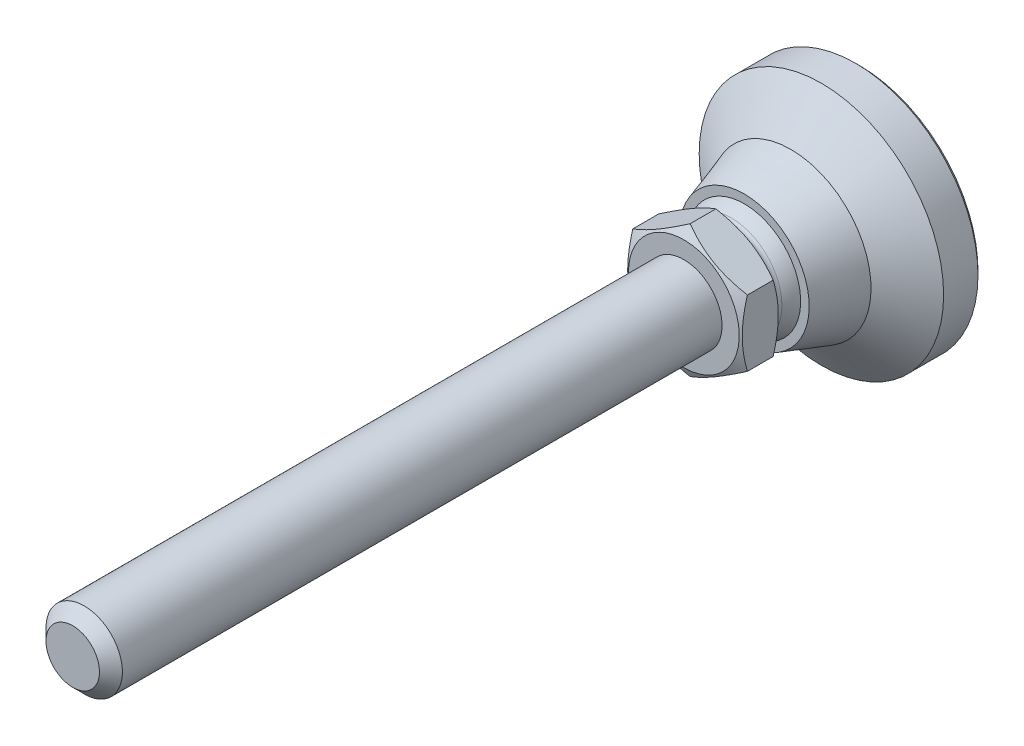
ISO-10303-21;
HEADER;
FILE_DESCRIPTION(('STEP AP214'),'2;1');
FILE_NAME('part.step','',(''),(''),'','','');
FILE_SCHEMA(('AUTOMOTIVE_DESIGN { 1 0 10303 214 1 1 1 1 }'));
ENDSEC;
DATA;
#1=APPLICATION_CONTEXT('core data for automotive mechanical design processes');
#2=APPLICATION_PROTOCOL_DEFINITION('international standard','automotive_design',2000,#1);
#3=PRODUCT_CONTEXT('',#1,'mechanical');
#4=PRODUCT('Part','Part','',(#3));
#5=PRODUCT_RELATED_PRODUCT_CATEGORY('part','',(#4));
#6=PRODUCT_DEFINITION_FORMATION('','',#4);
#7=PRODUCT_DEFINITION_CONTEXT('part definition',#1,'design');
#8=PRODUCT_DEFINITION('design','',#6,#7);
#9=PRODUCT_DEFINITION_SHAPE('','',#8);
#10=(LENGTH_UNIT() NAMED_UNIT(*) SI_UNIT(.MILLI.,.METRE.));
#11=(NAMED_UNIT(*) PLANE_ANGLE_UNIT() SI_UNIT($,.RADIAN.));
#12=(NAMED_UNIT(*) SI_UNIT($,.STERADIAN.) SOLID_ANGLE_UNIT());
#13=UNCERTAINTY_MEASURE_WITH_UNIT(LENGTH_MEASURE(1.E-05),#10,'distance_accuracy_value','');
#14=(GEOMETRIC_REPRESENTATION_CONTEXT(3) GLOBAL_UNCERTAINTY_ASSIGNED_CONTEXT((#13)) GLOBAL_UNIT_ASSIGNED_CONTEXT((#10,
#11,#12)) REPRESENTATION_CONTEXT('',''));
#15=CARTESIAN_POINT('',(0.,0.,0.));
#16=DIRECTION('',(0.,0.,1.));
#17=DIRECTION('',(1.,0.,0.));
#18=AXIS2_PLACEMENT_3D('',#15,#16,#17);
#19=CARTESIAN_POINT('',(-7.3851201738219,0.,15.1));
#20=DIRECTION('',(0.,0.,-1.));
#21=DIRECTION('',(0.,1.,0.));
#22=AXIS2_PLACEMENT_3D('',#19,#20,#21);
#23=PLANE('',#22);
#24=CARTESIAN_POINT('',(0.,0.,15.1));
#25=DIRECTION('',(0.,0.,-1.));
#26=DIRECTION('',(0.,1.,0.));
#27=AXIS2_PLACEMENT_3D('',#24,#25,#26);
#28=CIRCLE('',#27,8.5);
#29=CARTESIAN_POINT('',(0.,8.5,15.1));
#30=VERTEX_POINT('',#29);
#31=EDGE_CURVE('E73',#30,#30,#28,.T.);
#32=ORIENTED_EDGE('',*,*,#31,.F.);
#33=EDGE_LOOP('',(#32));
#34=FACE_BOUND('',#33,.T.);
#35=CARTESIAN_POINT('',(0.,0.,15.1));
#36=DIRECTION('',(0.,0.,-1.));
#37=DIRECTION('',(0.,1.,0.));
#38=AXIS2_PLACEMENT_3D('',#35,#36,#37);
#39=CIRCLE('',#38,7.38512017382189);
#40=CARTESIAN_POINT('',(-7.38512017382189,0.,15.1));
#41=VERTEX_POINT('',#40);
#42=EDGE_CURVE('E85',#41,#41,#39,.T.);
#43=ORIENTED_EDGE('',*,*,#42,.T.);
#44=EDGE_LOOP('',(#43));
#45=FACE_BOUND('',#44,.T.);
#46=ADVANCED_FACE('F14',(#34,#45),#23,.F.);
#47=CARTESIAN_POINT('',(0.,0.,15.1));
#48=DIRECTION('',(0.,0.,-1.));
#49=DIRECTION('',(0.,1.,0.));
#50=AXIS2_PLACEMENT_3D('',#47,#48,#49);
#51=CONICAL_SURFACE('',#50,8.5,0.316824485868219);
#52=CARTESIAN_POINT('',(0.,0.,9.));
#53=DIRECTION('',(0.,0.,-1.));
#54=DIRECTION('',(0.,1.,0.));
#55=AXIS2_PLACEMENT_3D('',#52,#53,#54);
#56=CIRCLE('',#55,10.5);
#57=CARTESIAN_POINT('',(0.,10.5,9.));
#58=VERTEX_POINT('',#57);
#59=EDGE_CURVE('E120',#58,#58,#56,.T.);
#60=ORIENTED_EDGE('',*,*,#59,.F.);
#61=EDGE_LOOP('',(#60));
#62=FACE_BOUND('',#61,.T.);
#63=ORIENTED_EDGE('',*,*,#31,.T.);
#64=EDGE_LOOP('',(#63));
#65=FACE_BOUND('',#64,.T.);
#66=ADVANCED_FACE('F241',(#62,#65),#51,.T.);
#67=CARTESIAN_POINT('',(0.,0.,9.));
#68=DIRECTION('',(0.,0.,-1.));
#69=DIRECTION('',(0.,1.,0.));
#70=AXIS2_PLACEMENT_3D('',#67,#68,#69);
#71=CONICAL_SURFACE('',#70,10.5,0.942000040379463);
#72=CARTESIAN_POINT('',(0.,0.,5.));
#73=DIRECTION('',(0.,0.,-1.));
#74=DIRECTION('',(0.,1.,0.));
#75=AXIS2_PLACEMENT_3D('',#72,#73,#74);
#76=CIRCLE('',#75,16.);
#77=CARTESIAN_POINT('',(0.,16.,5.));
#78=VERTEX_POINT('',#77);
#79=EDGE_CURVE('E117',#78,#78,#76,.T.);
#80=ORIENTED_EDGE('',*,*,#79,.F.);
#81=EDGE_LOOP('',(#80));
#82=FACE_BOUND('',#81,.T.);
#83=ORIENTED_EDGE('',*,*,#59,.T.);
#84=EDGE_LOOP('',(#83));
#85=FACE_BOUND('',#84,.T.);
#86=ADVANCED_FACE('F246',(#82,#85),#71,.T.);
#87=CARTESIAN_POINT('',(0.,0.,0.));
#88=DIRECTION('',(0.,0.,-1.));
#89=DIRECTION('',(0.,1.,0.));
#90=AXIS2_PLACEMENT_3D('',#87,#88,#89);
#91=CYLINDRICAL_SURFACE('',#90,16.);
#92=CARTESIAN_POINT('',(0.,0.,0.5));
#93=DIRECTION('',(0.,0.,-1.));
#94=DIRECTION('',(0.,1.,0.));
#95=AXIS2_PLACEMENT_3D('',#92,#93,#94);
#96=CIRCLE('',#95,16.);
#97=CARTESIAN_POINT('',(0.,16.,0.5));
#98=VERTEX_POINT('',#97);
#99=EDGE_CURVE('E114',#98,#98,#96,.T.);
#100=ORIENTED_EDGE('',*,*,#99,.F.);
#101=EDGE_LOOP('',(#100));
#102=FACE_BOUND('',#101,.T.);
#103=ORIENTED_EDGE('',*,*,#79,.T.);
#104=EDGE_LOOP('',(#103));
#105=FACE_BOUND('',#104,.T.);
#106=ADVANCED_FACE('F254',(#102,#105),#91,.T.);
#107=CARTESIAN_POINT('',(0.,0.,0.5));
#108=DIRECTION('',(0.,0.,1.));
#109=DIRECTION('',(0.,-1.,0.));
#110=AXIS2_PLACEMENT_3D('',#107,#108,#109);
#111=CONICAL_SURFACE('',#110,16.,0.785398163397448);
#112=CARTESIAN_POINT('',(0.,0.,0.));
#113=DIRECTION('',(0.,0.,-1.));
#114=DIRECTION('',(0.,1.,0.));
#115=AXIS2_PLACEMENT_3D('',#112,#113,#114);
#116=CIRCLE('',#115,15.5);
#117=CARTESIAN_POINT('',(0.,15.5,0.));
#118=VERTEX_POINT('',#117);
#119=EDGE_CURVE('E111',#118,#118,#116,.T.);
#120=ORIENTED_EDGE('',*,*,#119,.F.);
#121=EDGE_LOOP('',(#120));
#122=FACE_BOUND('',#121,.T.);
#123=ORIENTED_EDGE('',*,*,#99,.T.);
#124=EDGE_LOOP('',(#123));
#125=FACE_BOUND('',#124,.T.);
#126=ADVANCED_FACE('F258',(#122,#125),#111,.T.);
#127=CARTESIAN_POINT('',(0.,0.,0.));
#128=DIRECTION('',(0.,0.,1.));
#129=DIRECTION('',(0.,-1.,0.));
#130=AXIS2_PLACEMENT_3D('',#127,#128,#129);
#131=PLANE('',#130);
#132=ORIENTED_EDGE('',*,*,#119,.T.);
#133=EDGE_LOOP('',(#132));
#134=FACE_BOUND('',#133,.T.);
#135=ADVANCED_FACE('F262',(#134),#131,.F.);
#136=CARTESIAN_POINT('',(0.,0.,17.2011230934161));
#137=DIRECTION('',(0.,0.,-1.));
#138=DIRECTION('',(0.,1.,0.));
#139=AXIS2_PLACEMENT_3D('',#136,#137,#138);
#140=TOROIDAL_SURFACE('',#139,7.30000021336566,0.799999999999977);
#141=CARTESIAN_POINT('',(0.,0.,18.000000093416));
#142=DIRECTION('',(0.,0.,1.));
#143=DIRECTION('',(1.,0.,0.));
#144=AXIS2_PLACEMENT_3D('',#141,#142,#143);
#145=CIRCLE('',#144,7.25762641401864);
#146=CARTESIAN_POINT('',(7.25762641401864,0.,18.000000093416));
#147=VERTEX_POINT('',#146);
#148=EDGE_CURVE('E291',#147,#147,#145,.F.);
#149=ORIENTED_EDGE('',*,*,#148,.T.);
#150=EDGE_LOOP('',(#149));
#151=FACE_BOUND('',#150,.T.);
#152=CARTESIAN_POINT('',(0.,0.,16.7846437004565));
#153=DIRECTION('',(0.,0.,-1.));
#154=DIRECTION('',(0.,1.,0.));
#155=AXIS2_PLACEMENT_3D('',#152,#153,#154);
#156=CIRCLE('',#155,6.6169592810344);
#157=CARTESIAN_POINT('',(-6.61695928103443,0.,16.7846437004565));
#158=VERTEX_POINT('',#157);
#159=EDGE_CURVE('E88',#158,#158,#156,.T.);
#160=ORIENTED_EDGE('',*,*,#159,.F.);
#161=EDGE_LOOP('',(#160));
#162=FACE_BOUND('',#161,.T.);
#163=ADVANCED_FACE('F266',(#151,#162),#140,.F.);
#164=CARTESIAN_POINT('',(-1.12535508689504E-07,0.,12.7500000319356));
#165=DIRECTION('',(0.,0.,-1.));
#166=DIRECTION('',(-1.,0.,0.));
#167=AXIS2_PLACEMENT_3D('',#164,#165,#166);
#168=SPHERICAL_SURFACE('',#167,7.74999988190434);
#169=CARTESIAN_POINT('',(-7.38512017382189,0.,15.1));
#170=CARTESIAN_POINT('',(-7.37925798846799,0.,15.1184225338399));
#171=CARTESIAN_POINT('',(-7.37332686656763,0.,15.1368231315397));
#172=CARTESIAN_POINT('',(-7.36132708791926,0.,15.1735794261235));
#173=CARTESIAN_POINT('',(-7.35525843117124,0.,15.1919351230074));
#174=CARTESIAN_POINT('',(-7.34298392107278,0.,15.2286005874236));
#175=CARTESIAN_POINT('',(-7.33677806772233,0.,15.246910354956));
#176=CARTESIAN_POINT('',(-7.32422951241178,0.,15.2834829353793));
#177=CARTESIAN_POINT('',(-7.31788681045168,0.,15.3017457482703));
#178=CARTESIAN_POINT('',(-7.30506491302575,0.,15.3382233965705));
#179=CARTESIAN_POINT('',(-7.29858571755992,0.,15.3564382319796));
#180=CARTESIAN_POINT('',(-7.2854911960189,0.,15.3928189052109));
#181=CARTESIAN_POINT('',(-7.27887586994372,0.,15.4109847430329));
#182=CARTESIAN_POINT('',(-7.2655094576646,0.,15.447266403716));
#183=CARTESIAN_POINT('',(-7.25875837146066,0.,15.4653822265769));
#184=CARTESIAN_POINT('',(-7.2451208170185,0.,15.5015628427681));
#185=CARTESIAN_POINT('',(-7.23823434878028,0.,15.5196276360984));
#186=CARTESIAN_POINT('',(-7.22432641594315,0.,15.5557051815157));
#187=CARTESIAN_POINT('',(-7.21730495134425,0.,15.5737179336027));
#188=CARTESIAN_POINT('',(-7.20312741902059,0.,15.6096903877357));
#189=CARTESIAN_POINT('',(-7.19597135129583,0.,15.6276500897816));
#190=CARTESIAN_POINT('',(-7.18152501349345,0.,15.6635154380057));
#191=CARTESIAN_POINT('',(-7.17423474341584,0.,15.6814210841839));
#192=CARTESIAN_POINT('',(-7.15952040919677,0.,15.717177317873));
#193=CARTESIAN_POINT('',(-7.15209634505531,0.,15.7350279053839));
#194=CARTESIAN_POINT('',(-7.13711483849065,0.,15.7706730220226));
#195=CARTESIAN_POINT('',(-7.12955739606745,0.,15.7884675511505));
#196=CARTESIAN_POINT('',(-7.11430955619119,0.,15.8239995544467));
#197=CARTESIAN_POINT('',(-7.10661915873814,0.,15.8417370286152));
#198=CARTESIAN_POINT('',(-7.09110583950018,0.,15.8771539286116));
#199=CARTESIAN_POINT('',(-7.08328291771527,0.,15.8948333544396));
#200=CARTESIAN_POINT('',(-7.06750498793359,0.,15.9301331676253));
#201=CARTESIAN_POINT('',(-7.0595499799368,0.,15.9477535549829));
#202=CARTESIAN_POINT('',(-7.04350832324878,0.,15.9829343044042));
#203=CARTESIAN_POINT('',(-7.03542167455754,0.,16.0004946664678));
#204=CARTESIAN_POINT('',(-7.01911718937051,0.,16.0355543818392));
#205=CARTESIAN_POINT('',(-7.01089935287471,0.,16.0530537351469));
#206=CARTESIAN_POINT('',(-6.99433295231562,0.,16.0879904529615));
#207=CARTESIAN_POINT('',(-6.98598438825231,0.,16.1054278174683));
#208=CARTESIAN_POINT('',(-6.96915700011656,0.,16.1402395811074));
#209=CARTESIAN_POINT('',(-6.96067817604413,0.,16.1576139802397));
#210=CARTESIAN_POINT('',(-6.94359074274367,0.,16.1922988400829));
#211=CARTESIAN_POINT('',(-6.93498213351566,0.,16.2096093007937));
#212=CARTESIAN_POINT('',(-6.91763561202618,0.,16.2441653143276));
#213=CARTESIAN_POINT('',(-6.90889769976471,0.,16.2614108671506));
#214=CARTESIAN_POINT('',(-6.89129306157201,0.,16.2958360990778));
#215=CARTESIAN_POINT('',(-6.88242633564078,0.,16.313015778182));
#216=CARTESIAN_POINT('',(-6.86456456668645,0.,16.3473083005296));
#217=CARTESIAN_POINT('',(-6.85556952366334,0.,16.364421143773));
#218=CARTESIAN_POINT('',(-6.83745162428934,0.,16.3985790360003));
#219=CARTESIAN_POINT('',(-6.82832876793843,0.,16.4156240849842));
#220=CARTESIAN_POINT('',(-6.80995575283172,0.,16.4496454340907));
#221=CARTESIAN_POINT('',(-6.80070559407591,0.,16.4666217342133));
#222=CARTESIAN_POINT('',(-6.78207849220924,0.,16.5005046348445));
#223=CARTESIAN_POINT('',(-6.77270154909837,0.,16.517411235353));
#224=CARTESIAN_POINT('',(-6.75382140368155,0.,16.5511537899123));
#225=CARTESIAN_POINT('',(-6.7443182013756,0.,16.5679897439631));
#226=CARTESIAN_POINT('',(-6.72518606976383,0.,16.6015900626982));
#227=CARTESIAN_POINT('',(-6.71555714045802,0.,16.6183544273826));
#228=CARTESIAN_POINT('',(-6.69617409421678,0.,16.6518106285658));
#229=CARTESIAN_POINT('',(-6.68641997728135,0.,16.6685024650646));
#230=CARTESIAN_POINT('',(-6.66678710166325,0.,16.7018126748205));
#231=CARTESIAN_POINT('',(-6.65690834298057,0.,16.7184310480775));
#232=CARTESIAN_POINT('',(-6.63702673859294,0.,16.7515934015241));
#233=CARTESIAN_POINT('',(-6.627023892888,0.,16.7681373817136));
#234=CARTESIAN_POINT('',(-6.61695928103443,0.,16.7846437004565));
#235=B_SPLINE_CURVE_WITH_KNOTS('',3,(#169,#170,#171,#172,#173,#174,#175,#176,#177,#178,#179,
#180,#181,#182,#183,#184,#185,#186,#187,#188,#189,#190,#191,#192,#193,#194,#195,#196,#197,#198,
#199,#200,#201,#202,#203,#204,#205,#206,#207,#208,#209,#210,#211,#212,#213,#214,#215,#216,#217,
#218,#219,#220,#221,#222,#223,#224,#225,#226,#227,#228,#229,#230,#231,#232,#233,#234),
.UNSPECIFIED.,.F.,.F.,(4,2,2,2,2,2,2,2,2,2,2,2,2,2,2,2,2,2,2,2,2,2,2,2,2,2,2,2,2,2,2,2,4),(0.,
0.0579980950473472,0.115996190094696,0.173994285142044,0.231992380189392,0.28999047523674,
0.347988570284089,0.405986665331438,0.463984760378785,0.521982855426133,0.579980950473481,
0.637979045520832,0.695977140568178,0.753975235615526,0.811973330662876,0.869971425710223,
0.927969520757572,0.98596761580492,1.04396571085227,1.10196380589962,1.15996190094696,
1.21795999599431,1.27595809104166,1.33395618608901,1.39195428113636,1.44995237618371,
1.50795047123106,1.5659485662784,1.62394666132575,1.6819447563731,1.73994285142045,
1.79794094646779,1.85593904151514),.UNSPECIFIED.);
#236=EDGE_CURVE('BSEAM272',#41,#158,#235,.T.);
#237=ORIENTED_EDGE('',*,*,#42,.F.);
#238=ORIENTED_EDGE('',*,*,#159,.T.);
#239=ORIENTED_EDGE('',*,*,#236,.T.);
#240=ORIENTED_EDGE('',*,*,#236,.F.);
#241=EDGE_LOOP('',(#237,#239,#238,#240));
#242=FACE_BOUND('',#241,.T.);
#243=ADVANCED_FACE('F272',(#242),#168,.T.);
#244=CARTESIAN_POINT('',(0.,7.25,18.000000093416));
#245=DIRECTION('',(0.,0.,-1.));
#246=DIRECTION('',(-1.,0.,0.));
#247=AXIS2_PLACEMENT_3D('',#244,#245,#246);
#248=PLANE('',#247);
#249=CARTESIAN_POINT('',(0.,0.,18.000000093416));
#250=DIRECTION('',(0.,0.,-1.));
#251=DIRECTION('',(-1.,0.,0.));
#252=AXIS2_PLACEMENT_3D('',#249,#250,#251);
#253=CIRCLE('',#252,7.25);
#254=CARTESIAN_POINT('',(-7.25,0.,18.000000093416));
#255=VERTEX_POINT('',#254);
#256=EDGE_CURVE('E79',#255,#255,#253,.T.);
#257=ORIENTED_EDGE('',*,*,#256,.T.);
#258=EDGE_LOOP('',(#257));
#259=FACE_BOUND('',#258,.T.);
#260=ORIENTED_EDGE('',*,*,#148,.F.);
#261=EDGE_LOOP('',(#260));
#262=FACE_BOUND('',#261,.T.);
#263=ADVANCED_FACE('F139',(#259,#262),#248,.F.);
#264=CARTESIAN_POINT('',(0.,0.,19.9415360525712));
#265=DIRECTION('',(0.,0.,1.));
#266=DIRECTION('',(1.,0.,0.));
#267=AXIS2_PLACEMENT_3D('',#264,#265,#266);
#268=CONICAL_SURFACE('',#267,10.6128389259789,1.0471975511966);
#269=CARTESIAN_POINT('',(-7.5002,4.33001154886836,18.8142773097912));
#270=CARTESIAN_POINT('',(-7.3353416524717,4.42519256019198,18.7593329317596));
#271=CARTESIAN_POINT('',(-7.16986863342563,4.52072845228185,18.7068821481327));
#272=CARTESIAN_POINT('',(-6.83757877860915,4.71257608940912,18.6076545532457));
#273=CARTESIAN_POINT('',(-6.67076139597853,4.80888815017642,18.5608801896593));
#274=CARTESIAN_POINT('',(-6.16763831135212,5.09936639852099,18.4299898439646));
#275=CARTESIAN_POINT('',(-5.82934661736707,5.29467919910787,18.35554096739));
#276=CARTESIAN_POINT('',(-5.32309925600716,5.58696124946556,18.2682409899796));
#277=CARTESIAN_POINT('',(-5.15665618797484,5.68305719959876,18.2433717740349));
#278=CARTESIAN_POINT('',(-4.82301799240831,5.87568330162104,18.2016697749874));
#279=CARTESIAN_POINT('',(-4.65582293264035,5.97221341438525,18.1848362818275));
#280=CARTESIAN_POINT('',(-4.32114243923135,6.16544128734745,18.1596347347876));
#281=CARTESIAN_POINT('',(-4.15365755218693,6.26213873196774,18.1512570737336));
#282=CARTESIAN_POINT('',(-3.81854232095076,6.45561760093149,18.1431378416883));
#283=CARTESIAN_POINT('',(-3.65091198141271,6.55239902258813,18.1433960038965));
#284=CARTESIAN_POINT('',(-3.19166219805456,6.81754700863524,18.15597366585));
#285=CARTESIAN_POINT('',(-2.90019309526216,6.98582677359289,18.1770873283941));
#286=CARTESIAN_POINT('',(-2.31919079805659,7.32126860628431,18.2440382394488));
#287=CARTESIAN_POINT('',(-2.02965964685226,7.48842949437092,18.2898983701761));
#288=CARTESIAN_POINT('',(-1.44748813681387,7.82454637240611,18.4045351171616));
#289=CARTESIAN_POINT('',(-1.15492123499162,7.99345995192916,18.4737974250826));
#290=CARTESIAN_POINT('',(-0.574150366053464,8.3287681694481,18.6309948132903));
#291=CARTESIAN_POINT('',(-0.285938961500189,8.49516710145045,18.7188929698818));
#292=CARTESIAN_POINT('',(0.000200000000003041,8.66036950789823,18.8142773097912));
#293=B_SPLINE_CURVE_WITH_KNOTS('',3,(#269,#270,#271,#272,#273,#274,#275,#276,#277,#278,#279,
#280,#281,#282,#283,#284,#285,#286,#287,#288,#289,#290,#291,#292),.UNSPECIFIED.,.F.,.F.,(4,2,2,
2,2,2,2,2,2,2,2,4),(0.,0.594350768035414,1.1889569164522,2.38063993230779,2.96188692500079,
3.54308254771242,4.12361709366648,4.70413370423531,5.71473675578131,6.72627588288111,
7.76024925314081,8.79219281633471),.UNSPECIFIED.);
#294=CARTESIAN_POINT('',(-7.5,4.3301270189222,18.8142106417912));
#295=VERTEX_POINT('',#294);
#296=CARTESIAN_POINT('',(0.,8.66025403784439,18.8142106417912));
#297=VERTEX_POINT('',#296);
#298=EDGE_CURVE('E29',#295,#297,#293,.T.);
#299=ORIENTED_EDGE('',*,*,#298,.T.);
#300=CARTESIAN_POINT('',(-0.000199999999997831,8.66036950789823,18.8142773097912));
#301=CARTESIAN_POINT('',(0.164658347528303,8.56518849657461,18.7593329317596));
#302=CARTESIAN_POINT('',(0.330131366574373,8.46965260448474,18.7068821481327));
#303=CARTESIAN_POINT('',(0.662421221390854,8.27780496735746,18.6076545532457));
#304=CARTESIAN_POINT('',(0.829238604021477,8.18149290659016,18.5608801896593));
#305=CARTESIAN_POINT('',(1.33236168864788,7.8910146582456,18.4299898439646));
#306=CARTESIAN_POINT('',(1.67065338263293,7.69570185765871,18.35554096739));
#307=CARTESIAN_POINT('',(2.17690074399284,7.40341980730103,18.2682409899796));
#308=CARTESIAN_POINT('',(2.34334381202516,7.30732385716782,18.2433717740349));
#309=CARTESIAN_POINT('',(2.67698200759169,7.11469775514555,18.2016697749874));
#310=CARTESIAN_POINT('',(2.84417706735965,7.01816764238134,18.1848362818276));
#311=CARTESIAN_POINT('',(3.17885756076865,6.82493976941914,18.1596347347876));
#312=CARTESIAN_POINT('',(3.34634244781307,6.72824232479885,18.1512570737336));
#313=CARTESIAN_POINT('',(3.68145767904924,6.5347634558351,18.1431378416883));
#314=CARTESIAN_POINT('',(3.84908801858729,6.43798203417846,18.1433960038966));
#315=CARTESIAN_POINT('',(4.30833780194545,6.17283404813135,18.1559736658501));
#316=CARTESIAN_POINT('',(4.59980690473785,6.0045542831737,18.1770873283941));
#317=CARTESIAN_POINT('',(5.18080920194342,5.66911245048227,18.2440382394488));
#318=CARTESIAN_POINT('',(5.47034035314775,5.50195156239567,18.2898983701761));
#319=CARTESIAN_POINT('',(6.05251186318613,5.16583468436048,18.4045351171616));
#320=CARTESIAN_POINT('',(6.34507876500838,4.99692110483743,18.4737974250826));
#321=CARTESIAN_POINT('',(6.92584963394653,4.66161288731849,18.6309948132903));
#322=CARTESIAN_POINT('',(7.21406103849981,4.49521395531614,18.7188929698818));
#323=CARTESIAN_POINT('',(7.5002,4.33001154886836,18.8142773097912));
#324=B_SPLINE_CURVE_WITH_KNOTS('',3,(#300,#301,#302,#303,#304,#305,#306,#307,#308,#309,#310,
#311,#312,#313,#314,#315,#316,#317,#318,#319,#320,#321,#322,#323),.UNSPECIFIED.,.F.,.F.,(4,2,2,
2,2,2,2,2,2,2,2,4),(0.,0.594350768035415,1.1889569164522,2.38063993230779,2.96188692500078,
3.54308254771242,4.12361709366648,4.70413370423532,5.71473675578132,6.72627588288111,
7.7602492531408,8.7921928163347),.UNSPECIFIED.);
#325=CARTESIAN_POINT('',(7.5,4.3301270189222,18.8142106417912));
#326=VERTEX_POINT('',#325);
#327=EDGE_CURVE('E66',#297,#326,#324,.T.);
#328=ORIENTED_EDGE('',*,*,#327,.T.);
#329=CARTESIAN_POINT('',(7.5,-11.6210388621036,21.7995836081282));
#330=CARTESIAN_POINT('',(7.5,-11.2935497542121,21.6407631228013));
#331=CARTESIAN_POINT('',(7.5,-10.9653077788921,21.4834684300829));
#332=CARTESIAN_POINT('',(7.5,-10.3069176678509,21.1727889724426));
#333=CARTESIAN_POINT('',(7.5,-9.97676924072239,21.0194048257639));
#334=CARTESIAN_POINT('',(7.5,-9.31245989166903,20.7166309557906));
#335=CARTESIAN_POINT('',(7.5,-8.9782869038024,20.5672676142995));
#336=CARTESIAN_POINT('',(7.5,-8.30727950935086,20.27466703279));
#337=CARTESIAN_POINT('',(7.5,-7.97044522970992,20.1314295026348));
#338=CARTESIAN_POINT('',(7.5,-7.28274678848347,19.8482374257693));
#339=CARTESIAN_POINT('',(7.5,-6.93177846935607,19.7085344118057));
#340=CARTESIAN_POINT('',(7.5,-6.22573282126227,19.4397263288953));
#341=CARTESIAN_POINT('',(7.5,-5.87065503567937,19.3106224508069));
#342=CARTESIAN_POINT('',(7.5,-5.15648914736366,19.0664097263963));
#343=CARTESIAN_POINT('',(7.5,-4.79741086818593,18.951272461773));
#344=CARTESIAN_POINT('',(7.5,-4.0741164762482,18.7386927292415));
#345=CARTESIAN_POINT('',(7.5,-3.70990202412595,18.641244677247));
#346=CARTESIAN_POINT('',(7.5,-2.97808734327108,18.4692508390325));
#347=CARTESIAN_POINT('',(7.5,-2.61051701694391,18.3945812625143));
#348=CARTESIAN_POINT('',(7.5,-2.05582247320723,18.3028985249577));
#349=CARTESIAN_POINT('',(7.5,-1.87035408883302,18.275723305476));
#350=CARTESIAN_POINT('',(7.5,-1.49849891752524,18.2286800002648));
#351=CARTESIAN_POINT('',(7.5,-1.3121122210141,18.2088112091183));
#352=CARTESIAN_POINT('',(7.5,-0.941100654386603,18.1770252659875));
#353=CARTESIAN_POINT('',(7.5,-0.756484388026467,18.1650080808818));
#354=CARTESIAN_POINT('',(7.5,-0.386909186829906,18.148790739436));
#355=CARTESIAN_POINT('',(7.5,-0.201950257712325,18.144590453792));
#356=CARTESIAN_POINT('',(7.5,0.16797978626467,18.1441070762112));
#357=CARTESIAN_POINT('',(7.5,0.352950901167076,18.1478240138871));
#358=CARTESIAN_POINT('',(7.5,0.722572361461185,18.1630844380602));
#359=CARTESIAN_POINT('',(7.5,0.907222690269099,18.1746283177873));
#360=CARTESIAN_POINT('',(7.5,1.35130171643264,18.2115591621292));
#361=CARTESIAN_POINT('',(7.5,1.61042666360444,18.2406768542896));
#362=CARTESIAN_POINT('',(7.5,2.1267344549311,18.3127350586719));
#363=CARTESIAN_POINT('',(7.5,2.38391702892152,18.3556774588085));
#364=CARTESIAN_POINT('',(7.5,3.15226770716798,18.5029630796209));
#365=CARTESIAN_POINT('',(7.5,3.6599484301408,18.6257373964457));
#366=CARTESIAN_POINT('',(7.5,4.4190540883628,18.8384053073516));
#367=CARTESIAN_POINT('',(7.5,4.67442232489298,18.9150310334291));
#368=CARTESIAN_POINT('',(7.5,5.18267806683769,19.076183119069));
#369=CARTESIAN_POINT('',(7.5,5.43556555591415,19.1607095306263));
#370=CARTESIAN_POINT('',(7.5,5.93894047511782,19.336311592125));
#371=CARTESIAN_POINT('',(7.5,6.18942867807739,19.4273850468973));
#372=CARTESIAN_POINT('',(7.5,6.68833359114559,19.6150154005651));
#373=CARTESIAN_POINT('',(7.5,6.93675032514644,19.7115722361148));
#374=CARTESIAN_POINT('',(7.5,7.5215160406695,19.9451104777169));
#375=CARTESIAN_POINT('',(7.5,7.85708059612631,20.084052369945));
#376=CARTESIAN_POINT('',(7.5,8.52536966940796,20.3686255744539));
#377=CARTESIAN_POINT('',(7.5,8.85809401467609,20.5142572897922));
#378=CARTESIAN_POINT('',(7.5,9.521223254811,20.8108704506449));
#379=CARTESIAN_POINT('',(7.5,9.85162767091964,20.9618529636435));
#380=CARTESIAN_POINT('',(7.5,10.5104495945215,21.2681000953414));
#381=CARTESIAN_POINT('',(7.5,10.8388670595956,21.4233648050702));
#382=CARTESIAN_POINT('',(7.5,11.4943809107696,21.737538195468));
#383=CARTESIAN_POINT('',(7.5,11.821475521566,21.8964505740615));
#384=CARTESIAN_POINT('',(7.5,12.4742575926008,22.2171423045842));
#385=CARTESIAN_POINT('',(7.5,12.7999450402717,22.3789216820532));
#386=CARTESIAN_POINT('',(7.5,13.7751460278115,22.8677567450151));
#387=CARTESIAN_POINT('',(7.5,14.4228853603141,23.1983514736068));
#388=CARTESIAN_POINT('',(7.5,15.6609333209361,23.8382767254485));
#389=CARTESIAN_POINT('',(7.5,16.2515179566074,24.1470756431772));
#390=CARTESIAN_POINT('',(7.5,17.4304917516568,24.7688832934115));
#391=CARTESIAN_POINT('',(7.5,18.0188808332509,25.0818921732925));
#392=CARTESIAN_POINT('',(7.5,19.1924888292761,25.7103373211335));
#393=CARTESIAN_POINT('',(7.5,19.777711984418,26.0257656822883));
#394=CARTESIAN_POINT('',(7.5,20.9467538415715,26.6591392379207));
#395=CARTESIAN_POINT('',(7.5,21.530572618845,26.9770842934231));
#396=CARTESIAN_POINT('',(7.5,22.1138741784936,27.2959690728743));
#397=B_SPLINE_CURVE_WITH_KNOTS('',3,(#329,#330,#331,#332,#333,#334,#335,#336,#337,#338,#339,
#340,#341,#342,#343,#344,#345,#346,#347,#348,#349,#350,#351,#352,#353,#354,#355,#356,#357,#358,
#359,#360,#361,#362,#363,#364,#365,#366,#367,#368,#369,#370,#371,#372,#373,#374,#375,#376,#377,
#378,#379,#380,#381,#382,#383,#384,#385,#386,#387,#388,#389,#390,#391,#392,#393,#394,#395,#396),
.UNSPECIFIED.,.F.,.F.,(4,2,2,2,2,2,2,2,2,2,2,2,2,2,2,2,2,2,2,2,2,2,2,2,2,2,2,2,2,2,2,2,2,4),(0.,
1.09191885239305,2.18400927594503,3.28206244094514,4.38006354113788,5.5131832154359,
6.64643002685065,7.77733086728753,8.90787408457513,10.0321591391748,10.5943839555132,
11.1565544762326,11.7114152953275,12.2662669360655,12.8211206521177,13.3760022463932,
14.157827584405,14.9397597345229,16.504494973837,17.3042788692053,18.1040680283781,
18.9035902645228,19.7031032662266,20.7925815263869,21.8821255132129,22.971888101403,
24.0616738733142,25.1526180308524,26.2435719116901,28.4251893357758,30.4245018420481,
32.4238845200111,34.4183279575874,36.4126620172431),.UNSPECIFIED.);
#398=CARTESIAN_POINT('',(7.5,-4.3301270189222,18.8142106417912));
#399=VERTEX_POINT('',#398);
#400=EDGE_CURVE('E69',#326,#399,#397,.F.);
#401=ORIENTED_EDGE('',*,*,#400,.T.);
#402=CARTESIAN_POINT('',(7.5002,-4.33001154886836,18.8142773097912));
#403=CARTESIAN_POINT('',(7.3353416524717,-4.42519256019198,18.7593329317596));
#404=CARTESIAN_POINT('',(7.16986863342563,-4.52072845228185,18.7068821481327));
#405=CARTESIAN_POINT('',(6.83757877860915,-4.71257608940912,18.6076545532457));
#406=CARTESIAN_POINT('',(6.67076139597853,-4.80888815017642,18.5608801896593));
#407=CARTESIAN_POINT('',(6.16763831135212,-5.09936639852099,18.4299898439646));
#408=CARTESIAN_POINT('',(5.82934661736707,-5.29467919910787,18.35554096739));
#409=CARTESIAN_POINT('',(5.32309925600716,-5.58696124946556,18.2682409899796));
#410=CARTESIAN_POINT('',(5.15665618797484,-5.68305719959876,18.2433717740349));
#411=CARTESIAN_POINT('',(4.82301799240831,-5.87568330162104,18.2016697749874));
#412=CARTESIAN_POINT('',(4.65582293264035,-5.97221341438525,18.1848362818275));
#413=CARTESIAN_POINT('',(4.32114243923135,-6.16544128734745,18.1596347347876));
#414=CARTESIAN_POINT('',(4.15365755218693,-6.26213873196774,18.1512570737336));
#415=CARTESIAN_POINT('',(3.81854232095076,-6.45561760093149,18.1431378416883));
#416=CARTESIAN_POINT('',(3.65091198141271,-6.55239902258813,18.1433960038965));
#417=CARTESIAN_POINT('',(3.19166219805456,-6.81754700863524,18.15597366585));
#418=CARTESIAN_POINT('',(2.90019309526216,-6.98582677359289,18.1770873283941));
#419=CARTESIAN_POINT('',(2.31919079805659,-7.32126860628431,18.2440382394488));
#420=CARTESIAN_POINT('',(2.02965964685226,-7.48842949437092,18.2898983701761));
#421=CARTESIAN_POINT('',(1.44748813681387,-7.82454637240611,18.4045351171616));
#422=CARTESIAN_POINT('',(1.15492123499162,-7.99345995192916,18.4737974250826));
#423=CARTESIAN_POINT('',(0.574150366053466,-8.3287681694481,18.6309948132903));
#424=CARTESIAN_POINT('',(0.28593896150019,-8.49516710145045,18.7188929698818));
#425=CARTESIAN_POINT('',(-0.000200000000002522,-8.66036950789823,18.8142773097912));
#426=B_SPLINE_CURVE_WITH_KNOTS('',3,(#402,#403,#404,#405,#406,#407,#408,#409,#410,#411,#412,
#413,#414,#415,#416,#417,#418,#419,#420,#421,#422,#423,#424,#425),.UNSPECIFIED.,.F.,.F.,(4,2,2,
2,2,2,2,2,2,2,2,4),(0.,0.594350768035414,1.1889569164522,2.38063993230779,2.96188692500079,
3.54308254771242,4.12361709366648,4.70413370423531,5.71473675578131,6.72627588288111,
7.76024925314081,8.7921928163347),.UNSPECIFIED.);
#427=CARTESIAN_POINT('',(0.,-8.66025403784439,18.8142106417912));
#428=VERTEX_POINT('',#427);
#429=EDGE_CURVE('E78',#399,#428,#426,.T.);
#430=ORIENTED_EDGE('',*,*,#429,.T.);
#431=CARTESIAN_POINT('',(0.000199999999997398,-8.66036950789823,18.8142773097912));
#432=CARTESIAN_POINT('',(-0.164658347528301,-8.56518849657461,18.7593329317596));
#433=CARTESIAN_POINT('',(-0.33013136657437,-8.46965260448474,18.7068821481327));
#434=CARTESIAN_POINT('',(-0.66242122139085,-8.27780496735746,18.6076545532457));
#435=CARTESIAN_POINT('',(-0.829238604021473,-8.18149290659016,18.5608801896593));
#436=CARTESIAN_POINT('',(-1.33236168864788,-7.89101465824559,18.4299898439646));
#437=CARTESIAN_POINT('',(-1.67065338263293,-7.69570185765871,18.35554096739));
#438=CARTESIAN_POINT('',(-2.17690074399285,-7.40341980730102,18.2682409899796));
#439=CARTESIAN_POINT('',(-2.34334381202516,-7.30732385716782,18.2433717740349));
#440=CARTESIAN_POINT('',(-2.67698200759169,-7.11469775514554,18.2016697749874));
#441=CARTESIAN_POINT('',(-2.84417706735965,-7.01816764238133,18.1848362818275));
#442=CARTESIAN_POINT('',(-3.17885756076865,-6.82493976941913,18.1596347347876));
#443=CARTESIAN_POINT('',(-3.34634244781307,-6.72824232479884,18.1512570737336));
#444=CARTESIAN_POINT('',(-3.68145767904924,-6.53476345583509,18.1431378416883));
#445=CARTESIAN_POINT('',(-3.84908801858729,-6.43798203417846,18.1433960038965));
#446=CARTESIAN_POINT('',(-4.30833780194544,-6.17283404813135,18.15597366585));
#447=CARTESIAN_POINT('',(-4.59980690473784,-6.0045542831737,18.1770873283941));
#448=CARTESIAN_POINT('',(-5.18080920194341,-5.66911245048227,18.2440382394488));
#449=CARTESIAN_POINT('',(-5.47034035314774,-5.50195156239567,18.2898983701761));
#450=CARTESIAN_POINT('',(-6.05251186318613,-5.16583468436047,18.4045351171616));
#451=CARTESIAN_POINT('',(-6.34507876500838,-4.99692110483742,18.4737974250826));
#452=CARTESIAN_POINT('',(-6.92584963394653,-4.66161288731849,18.6309948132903));
#453=CARTESIAN_POINT('',(-7.21406103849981,-4.49521395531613,18.7188929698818));
#454=CARTESIAN_POINT('',(-7.5002,-4.33001154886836,18.8142773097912));
#455=B_SPLINE_CURVE_WITH_KNOTS('',3,(#431,#432,#433,#434,#435,#436,#437,#438,#439,#440,#441,
#442,#443,#444,#445,#446,#447,#448,#449,#450,#451,#452,#453,#454),.UNSPECIFIED.,.F.,.F.,(4,2,2,
2,2,2,2,2,2,2,2,4),(0.,0.594350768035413,1.1889569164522,2.38063993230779,2.96188692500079,
3.54308254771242,4.12361709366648,4.70413370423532,5.71473675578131,6.72627588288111,
7.76024925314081,8.7921928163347),.UNSPECIFIED.);
#456=CARTESIAN_POINT('',(-7.5,-4.3301270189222,18.8142106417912));
#457=VERTEX_POINT('',#456);
#458=EDGE_CURVE('E161',#428,#457,#455,.T.);
#459=ORIENTED_EDGE('',*,*,#458,.T.);
#460=CARTESIAN_POINT('',(-7.5,-11.6210388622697,21.7995836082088));
#461=CARTESIAN_POINT('',(-7.5,-11.2935497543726,21.6407631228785));
#462=CARTESIAN_POINT('',(-7.5,-10.965307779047,21.4834684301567));
#463=CARTESIAN_POINT('',(-7.5,-10.3069176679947,21.1727889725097));
#464=CARTESIAN_POINT('',(-7.5,-9.97676924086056,21.0194048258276));
#465=CARTESIAN_POINT('',(-7.5,-9.31245989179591,20.7166309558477));
#466=CARTESIAN_POINT('',(-7.5,-8.97828690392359,20.5672676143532));
#467=CARTESIAN_POINT('',(-7.5,-8.30727950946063,20.274667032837));
#468=CARTESIAN_POINT('',(-7.5,-7.97044522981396,20.1314295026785));
#469=CARTESIAN_POINT('',(-7.5,-7.28274678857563,19.8482374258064));
#470=CARTESIAN_POINT('',(-7.5,-6.93177846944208,19.7085344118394));
#471=CARTESIAN_POINT('',(-7.5,-6.22573282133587,19.4397263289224));
#472=CARTESIAN_POINT('',(-7.5,-5.87065503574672,19.3106224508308));
#473=CARTESIAN_POINT('',(-7.5,-5.15648914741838,19.0664097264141));
#474=CARTESIAN_POINT('',(-7.5,-4.79741086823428,18.9512724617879));
#475=CARTESIAN_POINT('',(-7.5,-4.07411647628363,18.7386927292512));
#476=CARTESIAN_POINT('',(-7.5,-3.70990202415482,18.6412446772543));
#477=CARTESIAN_POINT('',(-7.5,-2.97808734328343,18.4692508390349));
#478=CARTESIAN_POINT('',(-7.5,-2.61051701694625,18.3945812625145));
#479=CARTESIAN_POINT('',(-7.5,-2.05582247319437,18.3028985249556));
#480=CARTESIAN_POINT('',(-7.5,-1.87035408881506,18.2757233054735));
#481=CARTESIAN_POINT('',(-7.5,-1.49849891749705,18.2286800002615));
#482=CARTESIAN_POINT('',(-7.5,-1.31211222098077,18.2088112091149));
#483=CARTESIAN_POINT('',(-7.5,-0.941100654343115,18.1770252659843));
#484=CARTESIAN_POINT('',(-7.5,-0.756484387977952,18.1650080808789));
#485=CARTESIAN_POINT('',(-7.5,-0.386909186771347,18.1487907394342));
#486=CARTESIAN_POINT('',(-7.5,-0.201950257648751,18.144590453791));
#487=CARTESIAN_POINT('',(-7.5,0.167979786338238,18.1441070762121));
#488=CARTESIAN_POINT('',(-7.5,0.352950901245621,18.1478240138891));
#489=CARTESIAN_POINT('',(-7.5,0.722572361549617,18.163084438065));
#490=CARTESIAN_POINT('',(-7.5,0.90722269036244,18.1746283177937));
#491=CARTESIAN_POINT('',(-7.5,1.35130171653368,18.2115591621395));
#492=CARTESIAN_POINT('',(-7.5,1.61042666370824,18.2406768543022));
#493=CARTESIAN_POINT('',(-7.5,2.1267344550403,18.312735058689));
#494=CARTESIAN_POINT('',(-7.5,2.38391702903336,18.355677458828));
#495=CARTESIAN_POINT('',(-7.5,3.1522677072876,18.5029630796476));
#496=CARTESIAN_POINT('',(-7.5,3.6599484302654,18.6257373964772));
#497=CARTESIAN_POINT('',(-7.5,4.41905408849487,18.8384053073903));
#498=CARTESIAN_POINT('',(-7.5,4.67442232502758,18.9150310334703));
#499=CARTESIAN_POINT('',(-7.5,5.18267806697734,19.0761831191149));
#500=CARTESIAN_POINT('',(-7.5,5.43556555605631,19.1607095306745));
#501=CARTESIAN_POINT('',(-7.5,5.93894047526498,19.3363115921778));
#502=CARTESIAN_POINT('',(-7.5,6.18942867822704,19.4273850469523));
#503=CARTESIAN_POINT('',(-7.5,6.68833359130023,19.6150154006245));
#504=CARTESIAN_POINT('',(-7.5,6.93675032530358,19.7115722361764));
#505=CARTESIAN_POINT('',(-7.5,7.52151604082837,19.9451104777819));
#506=CARTESIAN_POINT('',(-7.5,7.85708059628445,20.084052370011));
#507=CARTESIAN_POINT('',(-7.5,8.52536966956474,20.3686255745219));
#508=CARTESIAN_POINT('',(-7.5,8.85809401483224,20.514257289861));
#509=CARTESIAN_POINT('',(-7.5,9.52122325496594,20.8108704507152));
#510=CARTESIAN_POINT('',(-7.5,9.85162767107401,20.9618529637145));
#511=CARTESIAN_POINT('',(-7.5,10.5104495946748,21.2681000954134));
#512=CARTESIAN_POINT('',(-7.5,10.8388670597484,21.4233648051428));
#513=CARTESIAN_POINT('',(-7.5,11.4943809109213,21.7375381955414));
#514=CARTESIAN_POINT('',(-7.5,11.8214755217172,21.8964505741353));
#515=CARTESIAN_POINT('',(-7.5,12.4742575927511,22.2171423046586));
#516=CARTESIAN_POINT('',(-7.5,12.7999450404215,22.3789216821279));
#517=CARTESIAN_POINT('',(-7.5,13.7751460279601,22.8677567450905));
#518=CARTESIAN_POINT('',(-7.5,14.4228853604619,23.1983514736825));
#519=CARTESIAN_POINT('',(-7.5,15.660933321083,23.838276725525));
#520=CARTESIAN_POINT('',(-7.5,16.2515179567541,24.1470756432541));
#521=CARTESIAN_POINT('',(-7.5,17.4304917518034,24.7688832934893));
#522=CARTESIAN_POINT('',(-7.5,18.0188808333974,25.0818921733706));
#523=CARTESIAN_POINT('',(-7.5,19.1924888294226,25.7103373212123));
#524=CARTESIAN_POINT('',(-7.5,19.7777119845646,26.0257656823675));
#525=CARTESIAN_POINT('',(-7.5,20.9467538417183,26.6591392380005));
#526=CARTESIAN_POINT('',(-7.5,21.5305726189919,26.9770842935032));
#527=CARTESIAN_POINT('',(-7.5,22.1138741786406,27.2959690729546));
#528=B_SPLINE_CURVE_WITH_KNOTS('',3,(#460,#461,#462,#463,#464,#465,#466,#467,#468,#469,#470,
#471,#472,#473,#474,#475,#476,#477,#478,#479,#480,#481,#482,#483,#484,#485,#486,#487,#488,#489,
#490,#491,#492,#493,#494,#495,#496,#497,#498,#499,#500,#501,#502,#503,#504,#505,#506,#507,#508,
#509,#510,#511,#512,#513,#514,#515,#516,#517,#518,#519,#520,#521,#522,#523,#524,#525,#526,#527),
.UNSPECIFIED.,.F.,.F.,(4,2,2,2,2,2,2,2,2,2,2,2,2,2,2,2,2,2,2,2,2,2,2,2,2,2,2,2,2,2,2,2,2,4),(0.,
1.09191885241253,2.18400927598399,3.2820624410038,4.38006354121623,5.51318321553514,
6.6464300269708,7.77733086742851,8.90787408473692,10.0321591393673,10.5943839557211,
11.1565544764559,11.7114152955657,12.2662669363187,12.8211206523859,13.3760022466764,
14.1578275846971,14.939759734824,16.5044949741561,17.3042788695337,18.1040680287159,
18.9035902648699,19.7031032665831,20.7925815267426,21.8821255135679,22.9718881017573,
24.0616738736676,25.1526180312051,26.2435719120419,28.4251893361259,30.4245018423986,
32.4238845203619,34.4183279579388,36.4126620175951),.UNSPECIFIED.);
#529=EDGE_CURVE('E168',#457,#295,#528,.T.);
#530=ORIENTED_EDGE('',*,*,#529,.T.);
#531=EDGE_LOOP('',(#299,#328,#401,#430,#459,#530));
#532=FACE_BOUND('',#531,.T.);
#533=ORIENTED_EDGE('',*,*,#256,.F.);
#534=EDGE_LOOP('',(#533));
#535=FACE_BOUND('',#534,.T.);
#536=ADVANCED_FACE('F67',(#532,#535),#268,.T.);
#537=CARTESIAN_POINT('',(-5.00000021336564,0.,23.0000000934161));
#538=DIRECTION('',(0.,0.,-1.));
#539=DIRECTION('',(0.,1.,0.));
#540=AXIS2_PLACEMENT_3D('',#537,#538,#539);
#541=PLANE('',#540);
#542=CARTESIAN_POINT('',(0.,0.,23.0000000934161));
#543=DIRECTION('',(0.,0.,-1.));
#544=DIRECTION('',(-1.,0.,0.));
#545=AXIS2_PLACEMENT_3D('',#542,#543,#544);
#546=CIRCLE('',#545,5.);
#547=CARTESIAN_POINT('',(-5.,0.,23.0000000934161));
#548=VERTEX_POINT('',#547);
#549=EDGE_CURVE('E131',#548,#548,#546,.T.);
#550=ORIENTED_EDGE('',*,*,#549,.T.);
#551=EDGE_LOOP('',(#550));
#552=FACE_BOUND('',#551,.T.);
#553=CARTESIAN_POINT('',(0.,0.,23.0000000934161));
#554=DIRECTION('',(0.,0.,-1.));
#555=DIRECTION('',(-1.,0.,0.));
#556=AXIS2_PLACEMENT_3D('',#553,#554,#555);
#557=CIRCLE('',#556,7.25);
#558=CARTESIAN_POINT('',(-7.25,0.,23.0000000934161));
#559=VERTEX_POINT('',#558);
#560=EDGE_CURVE('E292',#559,#559,#557,.T.);
#561=ORIENTED_EDGE('',*,*,#560,.F.);
#562=EDGE_LOOP('',(#561));
#563=FACE_BOUND('',#562,.T.);
#564=ADVANCED_FACE('F138',(#552,#563),#541,.F.);
#565=CARTESIAN_POINT('',(0.,0.,23.0000000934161));
#566=DIRECTION('',(0.,0.,-1.));
#567=DIRECTION('',(-1.,0.,0.));
#568=AXIS2_PLACEMENT_3D('',#565,#566,#567);
#569=CONICAL_SURFACE('',#568,7.25,1.0471975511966);
#570=CARTESIAN_POINT('',(0.000200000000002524,8.66036950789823,22.1857228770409));
#571=CARTESIAN_POINT('',(-0.164658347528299,8.56518849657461,22.2406672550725));
#572=CARTESIAN_POINT('',(-0.33013136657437,8.46965260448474,22.2931180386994));
#573=CARTESIAN_POINT('',(-0.662421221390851,8.27780496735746,22.3923456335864));
#574=CARTESIAN_POINT('',(-0.829238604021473,8.18149290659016,22.4391199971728));
#575=CARTESIAN_POINT('',(-1.33236168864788,7.89101465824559,22.5700103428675));
#576=CARTESIAN_POINT('',(-1.67065338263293,7.69570185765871,22.6444592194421));
#577=CARTESIAN_POINT('',(-2.17690074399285,7.40341980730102,22.7317591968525));
#578=CARTESIAN_POINT('',(-2.34334381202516,7.30732385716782,22.7566284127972));
#579=CARTESIAN_POINT('',(-2.67698200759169,7.11469775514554,22.7983304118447));
#580=CARTESIAN_POINT('',(-2.84417706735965,7.01816764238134,22.8151639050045));
#581=CARTESIAN_POINT('',(-3.17885756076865,6.82493976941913,22.8403654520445));
#582=CARTESIAN_POINT('',(-3.34634244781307,6.72824232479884,22.8487431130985));
#583=CARTESIAN_POINT('',(-3.68145767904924,6.5347634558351,22.8568623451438));
#584=CARTESIAN_POINT('',(-3.84908801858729,6.43798203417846,22.8566041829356));
#585=CARTESIAN_POINT('',(-4.30833780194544,6.17283404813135,22.8440265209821));
#586=CARTESIAN_POINT('',(-4.59980690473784,6.0045542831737,22.822912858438));
#587=CARTESIAN_POINT('',(-5.18080920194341,5.66911245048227,22.7559619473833));
#588=CARTESIAN_POINT('',(-5.47034035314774,5.50195156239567,22.7101018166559));
#589=CARTESIAN_POINT('',(-6.05251186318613,5.16583468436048,22.5954650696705));
#590=CARTESIAN_POINT('',(-6.34507876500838,4.99692110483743,22.5262027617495));
#591=CARTESIAN_POINT('',(-6.92584963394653,4.66161288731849,22.3690053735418));
#592=CARTESIAN_POINT('',(-7.21406103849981,4.49521395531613,22.2811072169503));
#593=CARTESIAN_POINT('',(-7.5002,4.33001154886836,22.1857228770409));
#594=B_SPLINE_CURVE_WITH_KNOTS('',3,(#570,#571,#572,#573,#574,#575,#576,#577,#578,#579,#580,
#581,#582,#583,#584,#585,#586,#587,#588,#589,#590,#591,#592,#593),.UNSPECIFIED.,.F.,.F.,(4,2,2,
2,2,2,2,2,2,2,2,4),(0.,0.594350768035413,1.1889569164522,2.38063993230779,2.96188692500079,
3.54308254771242,4.12361709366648,4.70413370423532,5.71473675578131,6.72627588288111,
7.7602492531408,8.7921928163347),.UNSPECIFIED.);
#595=CARTESIAN_POINT('',(0.,8.66025403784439,22.1857895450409));
#596=VERTEX_POINT('',#595);
#597=CARTESIAN_POINT('',(-7.5,4.3301270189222,22.1857895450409));
#598=VERTEX_POINT('',#597);
#599=EDGE_CURVE('E93',#596,#598,#594,.T.);
#600=ORIENTED_EDGE('',*,*,#599,.T.);
#601=CARTESIAN_POINT('',(-7.5,-11.6210388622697,19.2004165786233));
#602=CARTESIAN_POINT('',(-7.5,-11.2935497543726,19.3592370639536));
#603=CARTESIAN_POINT('',(-7.5,-10.965307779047,19.5165317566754));
#604=CARTESIAN_POINT('',(-7.5,-10.3069176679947,19.8272112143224));
#605=CARTESIAN_POINT('',(-7.5,-9.97676924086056,19.9805953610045));
#606=CARTESIAN_POINT('',(-7.5,-9.31245989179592,20.2833692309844));
#607=CARTESIAN_POINT('',(-7.5,-8.9782869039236,20.4327325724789));
#608=CARTESIAN_POINT('',(-7.5,-8.30727950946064,20.7253331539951));
#609=CARTESIAN_POINT('',(-7.5,-7.97044522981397,20.8685706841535));
#610=CARTESIAN_POINT('',(-7.5,-7.28274678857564,21.1517627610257));
#611=CARTESIAN_POINT('',(-7.5,-6.93177846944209,21.2914657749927));
#612=CARTESIAN_POINT('',(-7.5,-6.22573282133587,21.5602738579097));
#613=CARTESIAN_POINT('',(-7.5,-5.87065503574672,21.6893777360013));
#614=CARTESIAN_POINT('',(-7.5,-5.15648914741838,21.933590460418));
#615=CARTESIAN_POINT('',(-7.5,-4.79741086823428,22.0487277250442));
#616=CARTESIAN_POINT('',(-7.5,-4.07411647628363,22.2613074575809));
#617=CARTESIAN_POINT('',(-7.5,-3.70990202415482,22.3587555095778));
#618=CARTESIAN_POINT('',(-7.5,-2.97808734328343,22.5307493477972));
#619=CARTESIAN_POINT('',(-7.5,-2.61051701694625,22.6054189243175));
#620=CARTESIAN_POINT('',(-7.5,-2.05582247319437,22.6971016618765));
#621=CARTESIAN_POINT('',(-7.5,-1.87035408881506,22.7242768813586));
#622=CARTESIAN_POINT('',(-7.5,-1.49849891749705,22.7713201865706));
#623=CARTESIAN_POINT('',(-7.5,-1.31211222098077,22.7911889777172));
#624=CARTESIAN_POINT('',(-7.5,-0.941100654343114,22.8229749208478));
#625=CARTESIAN_POINT('',(-7.5,-0.756484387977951,22.8349921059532));
#626=CARTESIAN_POINT('',(-7.5,-0.386909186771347,22.8512094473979));
#627=CARTESIAN_POINT('',(-7.5,-0.20195025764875,22.8554097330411));
#628=CARTESIAN_POINT('',(-7.5,0.167979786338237,22.85589311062));
#629=CARTESIAN_POINT('',(-7.5,0.352950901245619,22.8521761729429));
#630=CARTESIAN_POINT('',(-7.5,0.722572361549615,22.8369157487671));
#631=CARTESIAN_POINT('',(-7.5,0.907222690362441,22.8253718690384));
#632=CARTESIAN_POINT('',(-7.5,1.35130171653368,22.7884410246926));
#633=CARTESIAN_POINT('',(-7.5,1.61042666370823,22.7593233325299));
#634=CARTESIAN_POINT('',(-7.5,2.12673445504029,22.687265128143));
#635=CARTESIAN_POINT('',(-7.5,2.38391702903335,22.644322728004));
#636=CARTESIAN_POINT('',(-7.5,3.15226770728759,22.4970371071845));
#637=CARTESIAN_POINT('',(-7.5,3.65994843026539,22.3742627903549));
#638=CARTESIAN_POINT('',(-7.5,4.41905408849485,22.1615948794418));
#639=CARTESIAN_POINT('',(-7.5,4.67442232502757,22.0849691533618));
#640=CARTESIAN_POINT('',(-7.5,5.18267806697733,21.9238170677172));
#641=CARTESIAN_POINT('',(-7.5,5.4355655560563,21.8392906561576));
#642=CARTESIAN_POINT('',(-7.5,5.93894047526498,21.6636885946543));
#643=CARTESIAN_POINT('',(-7.5,6.18942867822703,21.5726151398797));
#644=CARTESIAN_POINT('',(-7.5,6.68833359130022,21.3849847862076));
#645=CARTESIAN_POINT('',(-7.5,6.93675032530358,21.2884279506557));
#646=CARTESIAN_POINT('',(-7.5,7.52151604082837,21.0548897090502));
#647=CARTESIAN_POINT('',(-7.5,7.85708059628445,20.915947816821));
#648=CARTESIAN_POINT('',(-7.5,8.52536966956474,20.6313746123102));
#649=CARTESIAN_POINT('',(-7.5,8.85809401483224,20.485742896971));
#650=CARTESIAN_POINT('',(-7.5,9.52122325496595,20.1891297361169));
#651=CARTESIAN_POINT('',(-7.5,9.85162767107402,20.0381472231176));
#652=CARTESIAN_POINT('',(-7.5,10.5104495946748,19.7319000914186));
#653=CARTESIAN_POINT('',(-7.5,10.8388670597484,19.5766353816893));
#654=CARTESIAN_POINT('',(-7.5,11.4943809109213,19.2624619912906));
#655=CARTESIAN_POINT('',(-7.5,11.8214755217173,19.1035496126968));
#656=CARTESIAN_POINT('',(-7.5,12.4742575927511,18.7828578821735));
#657=CARTESIAN_POINT('',(-7.5,12.7999450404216,18.6210785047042));
#658=CARTESIAN_POINT('',(-7.5,13.7751460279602,18.1322434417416));
#659=CARTESIAN_POINT('',(-7.5,14.422885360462,17.8016487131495));
#660=CARTESIAN_POINT('',(-7.5,15.660933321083,17.1617234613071));
#661=CARTESIAN_POINT('',(-7.5,16.2515179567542,16.8529245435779));
#662=CARTESIAN_POINT('',(-7.5,17.4304917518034,16.2311168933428));
#663=CARTESIAN_POINT('',(-7.5,18.0188808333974,15.9181080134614));
#664=CARTESIAN_POINT('',(-7.5,19.1924888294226,15.2896628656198));
#665=CARTESIAN_POINT('',(-7.5,19.7777119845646,14.9742345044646));
#666=CARTESIAN_POINT('',(-7.5,20.9467538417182,14.3408609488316));
#667=CARTESIAN_POINT('',(-7.5,21.5305726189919,14.022915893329));
#668=CARTESIAN_POINT('',(-7.5,22.1138741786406,13.7040311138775));
#669=B_SPLINE_CURVE_WITH_KNOTS('',3,(#601,#602,#603,#604,#605,#606,#607,#608,#609,#610,#611,
#612,#613,#614,#615,#616,#617,#618,#619,#620,#621,#622,#623,#624,#625,#626,#627,#628,#629,#630,
#631,#632,#633,#634,#635,#636,#637,#638,#639,#640,#641,#642,#643,#644,#645,#646,#647,#648,#649,
#650,#651,#652,#653,#654,#655,#656,#657,#658,#659,#660,#661,#662,#663,#664,#665,#666,#667,#668),
.UNSPECIFIED.,.F.,.F.,(4,2,2,2,2,2,2,2,2,2,2,2,2,2,2,2,2,2,2,2,2,2,2,2,2,2,2,2,2,2,2,2,2,4),(0.,
1.09191885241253,2.18400927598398,3.28206244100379,4.38006354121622,5.51318321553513,
6.64643002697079,7.77733086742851,8.90787408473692,10.0321591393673,10.5943839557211,
11.1565544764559,11.7114152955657,12.2662669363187,12.8211206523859,13.3760022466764,
14.1578275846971,14.939759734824,16.5044949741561,17.3042788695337,18.1040680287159,
18.9035902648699,19.7031032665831,20.7925815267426,21.8821255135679,22.9718881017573,
24.0616738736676,25.1526180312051,26.2435719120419,28.425189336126,30.4245018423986,
32.4238845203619,34.4183279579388,36.4126620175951),.UNSPECIFIED.);
#670=CARTESIAN_POINT('',(-7.5,-4.3301270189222,22.1857895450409));
#671=VERTEX_POINT('',#670);
#672=EDGE_CURVE('E188',#598,#671,#669,.F.);
#673=ORIENTED_EDGE('',*,*,#672,.T.);
#674=CARTESIAN_POINT('',(-7.5002,-4.33001154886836,22.1857228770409));
#675=CARTESIAN_POINT('',(-7.3353416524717,-4.42519256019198,22.2406672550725));
#676=CARTESIAN_POINT('',(-7.16986863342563,-4.52072845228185,22.2931180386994));
#677=CARTESIAN_POINT('',(-6.83757877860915,-4.71257608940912,22.3923456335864));
#678=CARTESIAN_POINT('',(-6.67076139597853,-4.80888815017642,22.4391199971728));
#679=CARTESIAN_POINT('',(-6.16763831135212,-5.09936639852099,22.5700103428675));
#680=CARTESIAN_POINT('',(-5.82934661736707,-5.29467919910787,22.6444592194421));
#681=CARTESIAN_POINT('',(-5.32309925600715,-5.58696124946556,22.7317591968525));
#682=CARTESIAN_POINT('',(-5.15665618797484,-5.68305719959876,22.7566284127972));
#683=CARTESIAN_POINT('',(-4.82301799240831,-5.87568330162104,22.7983304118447));
#684=CARTESIAN_POINT('',(-4.65582293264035,-5.97221341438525,22.8151639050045));
#685=CARTESIAN_POINT('',(-4.32114243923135,-6.16544128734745,22.8403654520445));
#686=CARTESIAN_POINT('',(-4.15365755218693,-6.26213873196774,22.8487431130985));
#687=CARTESIAN_POINT('',(-3.81854232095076,-6.45561760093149,22.8568623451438));
#688=CARTESIAN_POINT('',(-3.65091198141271,-6.55239902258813,22.8566041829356));
#689=CARTESIAN_POINT('',(-3.19166219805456,-6.81754700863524,22.8440265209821));
#690=CARTESIAN_POINT('',(-2.90019309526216,-6.98582677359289,22.822912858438));
#691=CARTESIAN_POINT('',(-2.31919079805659,-7.32126860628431,22.7559619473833));
#692=CARTESIAN_POINT('',(-2.02965964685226,-7.48842949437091,22.710101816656));
#693=CARTESIAN_POINT('',(-1.44748813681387,-7.82454637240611,22.5954650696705));
#694=CARTESIAN_POINT('',(-1.15492123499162,-7.99345995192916,22.5262027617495));
#695=CARTESIAN_POINT('',(-0.57415036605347,-8.32876816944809,22.3690053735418));
#696=CARTESIAN_POINT('',(-0.285938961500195,-8.49516710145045,22.2811072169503));
#697=CARTESIAN_POINT('',(0.000199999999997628,-8.66036950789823,22.1857228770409));
#698=B_SPLINE_CURVE_WITH_KNOTS('',3,(#674,#675,#676,#677,#678,#679,#680,#681,#682,#683,#684,
#685,#686,#687,#688,#689,#690,#691,#692,#693,#694,#695,#696,#697),.UNSPECIFIED.,.F.,.F.,(4,2,2,
2,2,2,2,2,2,2,2,4),(0.,0.594350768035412,1.1889569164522,2.38063993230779,2.96188692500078,
3.54308254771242,4.12361709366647,4.70413370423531,5.71473675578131,6.72627588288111,
7.7602492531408,8.7921928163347),.UNSPECIFIED.);
#699=CARTESIAN_POINT('',(0.,-8.66025403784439,22.1857895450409));
#700=VERTEX_POINT('',#699);
#701=EDGE_CURVE('E195',#671,#700,#698,.T.);
#702=ORIENTED_EDGE('',*,*,#701,.T.);
#703=CARTESIAN_POINT('',(-0.000200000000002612,-8.66036950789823,22.1857228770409));
#704=CARTESIAN_POINT('',(0.164658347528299,-8.56518849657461,22.2406672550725));
#705=CARTESIAN_POINT('',(0.33013136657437,-8.46965260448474,22.2931180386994));
#706=CARTESIAN_POINT('',(0.662421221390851,-8.27780496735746,22.3923456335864));
#707=CARTESIAN_POINT('',(0.829238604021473,-8.18149290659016,22.4391199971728));
#708=CARTESIAN_POINT('',(1.33236168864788,-7.89101465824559,22.5700103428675));
#709=CARTESIAN_POINT('',(1.67065338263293,-7.69570185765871,22.6444592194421));
#710=CARTESIAN_POINT('',(2.17690074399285,-7.40341980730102,22.7317591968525));
#711=CARTESIAN_POINT('',(2.34334381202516,-7.30732385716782,22.7566284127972));
#712=CARTESIAN_POINT('',(2.67698200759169,-7.11469775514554,22.7983304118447));
#713=CARTESIAN_POINT('',(2.84417706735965,-7.01816764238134,22.8151639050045));
#714=CARTESIAN_POINT('',(3.17885756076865,-6.82493976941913,22.8403654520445));
#715=CARTESIAN_POINT('',(3.34634244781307,-6.72824232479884,22.8487431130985));
#716=CARTESIAN_POINT('',(3.68145767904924,-6.5347634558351,22.8568623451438));
#717=CARTESIAN_POINT('',(3.84908801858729,-6.43798203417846,22.8566041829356));
#718=CARTESIAN_POINT('',(4.30833780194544,-6.17283404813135,22.8440265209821));
#719=CARTESIAN_POINT('',(4.59980690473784,-6.0045542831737,22.822912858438));
#720=CARTESIAN_POINT('',(5.18080920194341,-5.66911245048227,22.7559619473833));
#721=CARTESIAN_POINT('',(5.47034035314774,-5.50195156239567,22.7101018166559));
#722=CARTESIAN_POINT('',(6.05251186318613,-5.16583468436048,22.5954650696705));
#723=CARTESIAN_POINT('',(6.34507876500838,-4.99692110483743,22.5262027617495));
#724=CARTESIAN_POINT('',(6.92584963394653,-4.66161288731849,22.3690053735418));
#725=CARTESIAN_POINT('',(7.21406103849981,-4.49521395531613,22.2811072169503));
#726=CARTESIAN_POINT('',(7.5002,-4.33001154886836,22.1857228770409));
#727=B_SPLINE_CURVE_WITH_KNOTS('',3,(#703,#704,#705,#706,#707,#708,#709,#710,#711,#712,#713,
#714,#715,#716,#717,#718,#719,#720,#721,#722,#723,#724,#725,#726),.UNSPECIFIED.,.F.,.F.,(4,2,2,
2,2,2,2,2,2,2,2,4),(0.,0.594350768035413,1.1889569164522,2.38063993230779,2.96188692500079,
3.54308254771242,4.12361709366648,4.70413370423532,5.71473675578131,6.72627588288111,
7.7602492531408,8.7921928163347),.UNSPECIFIED.);
#728=CARTESIAN_POINT('',(7.5,-4.3301270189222,22.1857895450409));
#729=VERTEX_POINT('',#728);
#730=EDGE_CURVE('E223',#700,#729,#727,.T.);
#731=ORIENTED_EDGE('',*,*,#730,.T.);
#732=CARTESIAN_POINT('',(7.5,-11.6210388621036,19.2004165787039));
#733=CARTESIAN_POINT('',(7.5,-11.2935497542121,19.3592370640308));
#734=CARTESIAN_POINT('',(7.5,-10.9653077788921,19.5165317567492));
#735=CARTESIAN_POINT('',(7.5,-10.3069176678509,19.8272112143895));
#736=CARTESIAN_POINT('',(7.5,-9.97676924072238,19.9805953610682));
#737=CARTESIAN_POINT('',(7.5,-9.31245989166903,20.2833692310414));
#738=CARTESIAN_POINT('',(7.5,-8.9782869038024,20.4327325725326));
#739=CARTESIAN_POINT('',(7.5,-8.30727950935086,20.7253331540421));
#740=CARTESIAN_POINT('',(7.5,-7.97044522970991,20.8685706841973));
#741=CARTESIAN_POINT('',(7.5,-7.28274678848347,21.1517627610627));
#742=CARTESIAN_POINT('',(7.5,-6.93177846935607,21.2914657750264));
#743=CARTESIAN_POINT('',(7.5,-6.22573282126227,21.5602738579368));
#744=CARTESIAN_POINT('',(7.5,-5.87065503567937,21.6893777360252));
#745=CARTESIAN_POINT('',(7.5,-5.15648914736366,21.9335904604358));
#746=CARTESIAN_POINT('',(7.5,-4.79741086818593,22.0487277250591));
#747=CARTESIAN_POINT('',(7.5,-4.0741164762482,22.2613074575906));
#748=CARTESIAN_POINT('',(7.5,-3.70990202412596,22.3587555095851));
#749=CARTESIAN_POINT('',(7.5,-2.97808734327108,22.5307493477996));
#750=CARTESIAN_POINT('',(7.5,-2.61051701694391,22.6054189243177));
#751=CARTESIAN_POINT('',(7.5,-2.05582247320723,22.6971016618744));
#752=CARTESIAN_POINT('',(7.5,-1.87035408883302,22.724276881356));
#753=CARTESIAN_POINT('',(7.5,-1.49849891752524,22.7713201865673));
#754=CARTESIAN_POINT('',(7.5,-1.31211222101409,22.7911889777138));
#755=CARTESIAN_POINT('',(7.5,-0.941100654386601,22.8229749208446));
#756=CARTESIAN_POINT('',(7.5,-0.756484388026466,22.8349921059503));
#757=CARTESIAN_POINT('',(7.5,-0.386909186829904,22.8512094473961));
#758=CARTESIAN_POINT('',(7.5,-0.201950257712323,22.8554097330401));
#759=CARTESIAN_POINT('',(7.5,0.167979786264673,22.8558931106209));
#760=CARTESIAN_POINT('',(7.5,0.352950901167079,22.852176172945));
#761=CARTESIAN_POINT('',(7.5,0.722572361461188,22.8369157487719));
#762=CARTESIAN_POINT('',(7.5,0.907222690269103,22.8253718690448));
#763=CARTESIAN_POINT('',(7.5,1.35130171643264,22.7884410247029));
#764=CARTESIAN_POINT('',(7.5,1.61042666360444,22.7593233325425));
#765=CARTESIAN_POINT('',(7.5,2.1267344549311,22.6872651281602));
#766=CARTESIAN_POINT('',(7.5,2.38391702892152,22.6443227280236));
#767=CARTESIAN_POINT('',(7.5,3.15226770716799,22.4970371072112));
#768=CARTESIAN_POINT('',(7.5,3.6599484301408,22.3742627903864));
#769=CARTESIAN_POINT('',(7.5,4.4190540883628,22.1615948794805));
#770=CARTESIAN_POINT('',(7.5,4.67442232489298,22.0849691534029));
#771=CARTESIAN_POINT('',(7.5,5.1826780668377,21.923817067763));
#772=CARTESIAN_POINT('',(7.5,5.43556555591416,21.8392906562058));
#773=CARTESIAN_POINT('',(7.5,5.93894047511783,21.6636885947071));
#774=CARTESIAN_POINT('',(7.5,6.18942867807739,21.5726151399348));
#775=CARTESIAN_POINT('',(7.5,6.68833359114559,21.384984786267));
#776=CARTESIAN_POINT('',(7.5,6.93675032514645,21.2884279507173));
#777=CARTESIAN_POINT('',(7.5,7.52151604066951,21.0548897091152));
#778=CARTESIAN_POINT('',(7.5,7.85708059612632,20.9159478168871));
#779=CARTESIAN_POINT('',(7.5,8.52536966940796,20.6313746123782));
#780=CARTESIAN_POINT('',(7.5,8.85809401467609,20.4857428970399));
#781=CARTESIAN_POINT('',(7.5,9.52122325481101,20.1891297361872));
#782=CARTESIAN_POINT('',(7.5,9.85162767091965,20.0381472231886));
#783=CARTESIAN_POINT('',(7.5,10.5104495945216,19.7319000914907));
#784=CARTESIAN_POINT('',(7.5,10.8388670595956,19.5766353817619));
#785=CARTESIAN_POINT('',(7.5,11.4943809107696,19.262461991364));
#786=CARTESIAN_POINT('',(7.5,11.821475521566,19.1035496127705));
#787=CARTESIAN_POINT('',(7.5,12.4742575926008,18.7828578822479));
#788=CARTESIAN_POINT('',(7.5,12.7999450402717,18.6210785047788));
#789=CARTESIAN_POINT('',(7.5,13.7751460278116,18.132243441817));
#790=CARTESIAN_POINT('',(7.5,14.4228853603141,17.8016487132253));
#791=CARTESIAN_POINT('',(7.5,15.6609333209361,17.1617234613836));
#792=CARTESIAN_POINT('',(7.5,16.2515179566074,16.8529245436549));
#793=CARTESIAN_POINT('',(7.5,17.4304917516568,16.2311168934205));
#794=CARTESIAN_POINT('',(7.5,18.0188808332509,15.9181080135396));
#795=CARTESIAN_POINT('',(7.5,19.1924888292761,15.2896628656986));
#796=CARTESIAN_POINT('',(7.5,19.777711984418,14.9742345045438));
#797=CARTESIAN_POINT('',(7.5,20.9467538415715,14.3408609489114));
#798=CARTESIAN_POINT('',(7.5,21.530572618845,14.022915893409));
#799=CARTESIAN_POINT('',(7.5,22.1138741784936,13.7040311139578));
#800=B_SPLINE_CURVE_WITH_KNOTS('',3,(#732,#733,#734,#735,#736,#737,#738,#739,#740,#741,#742,
#743,#744,#745,#746,#747,#748,#749,#750,#751,#752,#753,#754,#755,#756,#757,#758,#759,#760,#761,
#762,#763,#764,#765,#766,#767,#768,#769,#770,#771,#772,#773,#774,#775,#776,#777,#778,#779,#780,
#781,#782,#783,#784,#785,#786,#787,#788,#789,#790,#791,#792,#793,#794,#795,#796,#797,#798,#799),
.UNSPECIFIED.,.F.,.F.,(4,2,2,2,2,2,2,2,2,2,2,2,2,2,2,2,2,2,2,2,2,2,2,2,2,2,2,2,2,2,2,2,2,4),(0.,
1.09191885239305,2.18400927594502,3.28206244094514,4.38006354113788,5.51318321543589,
6.64643002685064,7.77733086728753,8.90787408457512,10.0321591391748,10.5943839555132,
11.1565544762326,11.7114152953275,12.2662669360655,12.8211206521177,13.3760022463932,
14.157827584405,14.9397597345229,16.504494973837,17.3042788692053,18.1040680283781,
18.9035902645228,19.7031032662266,20.7925815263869,21.8821255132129,22.971888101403,
24.0616738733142,25.1526180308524,26.2435719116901,28.4251893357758,30.4245018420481,
32.4238845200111,34.4183279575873,36.412662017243),.UNSPECIFIED.);
#801=CARTESIAN_POINT('',(7.5,4.3301270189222,22.1857895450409));
#802=VERTEX_POINT('',#801);
#803=EDGE_CURVE('E217',#729,#802,#800,.T.);
#804=ORIENTED_EDGE('',*,*,#803,.T.);
#805=CARTESIAN_POINT('',(7.5002,4.33001154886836,22.1857228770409));
#806=CARTESIAN_POINT('',(7.3353416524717,4.42519256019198,22.2406672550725));
#807=CARTESIAN_POINT('',(7.16986863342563,4.52072845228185,22.2931180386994));
#808=CARTESIAN_POINT('',(6.83757877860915,4.71257608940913,22.3923456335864));
#809=CARTESIAN_POINT('',(6.67076139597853,4.80888815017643,22.4391199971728));
#810=CARTESIAN_POINT('',(6.16763831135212,5.099366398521,22.5700103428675));
#811=CARTESIAN_POINT('',(5.82934661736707,5.29467919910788,22.6444592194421));
#812=CARTESIAN_POINT('',(5.32309925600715,5.58696124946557,22.7317591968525));
#813=CARTESIAN_POINT('',(5.15665618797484,5.68305719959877,22.7566284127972));
#814=CARTESIAN_POINT('',(4.82301799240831,5.87568330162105,22.7983304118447));
#815=CARTESIAN_POINT('',(4.65582293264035,5.97221341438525,22.8151639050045));
#816=CARTESIAN_POINT('',(4.32114243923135,6.16544128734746,22.8403654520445));
#817=CARTESIAN_POINT('',(4.15365755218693,6.26213873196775,22.8487431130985));
#818=CARTESIAN_POINT('',(3.81854232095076,6.45561760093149,22.8568623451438));
#819=CARTESIAN_POINT('',(3.65091198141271,6.55239902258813,22.8566041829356));
#820=CARTESIAN_POINT('',(3.19166219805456,6.81754700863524,22.8440265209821));
#821=CARTESIAN_POINT('',(2.90019309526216,6.98582677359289,22.822912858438));
#822=CARTESIAN_POINT('',(2.31919079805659,7.32126860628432,22.7559619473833));
#823=CARTESIAN_POINT('',(2.02965964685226,7.48842949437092,22.7101018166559));
#824=CARTESIAN_POINT('',(1.44748813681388,7.82454637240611,22.5954650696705));
#825=CARTESIAN_POINT('',(1.15492123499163,7.99345995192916,22.5262027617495));
#826=CARTESIAN_POINT('',(0.574150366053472,8.3287681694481,22.3690053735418));
#827=CARTESIAN_POINT('',(0.285938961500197,8.49516710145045,22.2811072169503));
#828=CARTESIAN_POINT('',(-0.000199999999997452,8.66036950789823,22.1857228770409));
#829=B_SPLINE_CURVE_WITH_KNOTS('',3,(#805,#806,#807,#808,#809,#810,#811,#812,#813,#814,#815,
#816,#817,#818,#819,#820,#821,#822,#823,#824,#825,#826,#827,#828),.UNSPECIFIED.,.F.,.F.,(4,2,2,
2,2,2,2,2,2,2,2,4),(0.,0.594350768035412,1.1889569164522,2.38063993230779,2.96188692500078,
3.54308254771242,4.12361709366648,4.70413370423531,5.71473675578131,6.72627588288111,
7.7602492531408,8.7921928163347),.UNSPECIFIED.);
#830=EDGE_CURVE('E84',#802,#596,#829,.T.);
#831=ORIENTED_EDGE('',*,*,#830,.T.);
#832=EDGE_LOOP('',(#600,#673,#702,#731,#804,#831));
#833=FACE_BOUND('',#832,.T.);
#834=ORIENTED_EDGE('',*,*,#560,.T.);
#835=EDGE_LOOP('',(#834));
#836=FACE_BOUND('',#835,.T.);
#837=ADVANCED_FACE('F201',(#833,#836),#569,.T.);
#838=CARTESIAN_POINT('',(7.5,4.3301270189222,-38.9335365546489));
#839=DIRECTION('',(0.5,0.866025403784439,0.));
#840=DIRECTION('',(-0.866025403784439,0.5,0.));
#841=AXIS2_PLACEMENT_3D('',#838,#839,#840);
#842=PLANE('',#841);
#843=ORIENTED_EDGE('',*,*,#327,.F.);
#844=DIRECTION('',(0.,0.,1.));
#845=VECTOR('',#844,1.);
#846=CARTESIAN_POINT('',(0.,8.66025403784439,-38.9335365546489));
#847=LINE('',#846,#845);
#848=EDGE_CURVE('E107',#297,#596,#847,.T.);
#849=ORIENTED_EDGE('',*,*,#848,.T.);
#850=ORIENTED_EDGE('',*,*,#830,.F.);
#851=DIRECTION('',(0.,0.,1.));
#852=VECTOR('',#851,1.);
#853=CARTESIAN_POINT('',(7.5,4.3301270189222,-38.9335365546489));
#854=LINE('',#853,#852);
#855=EDGE_CURVE('E37',#326,#802,#854,.T.);
#856=ORIENTED_EDGE('',*,*,#855,.F.);
#857=EDGE_LOOP('',(#843,#849,#850,#856));
#858=FACE_BOUND('',#857,.T.);
#859=ADVANCED_FACE('F82',(#858),#842,.T.);
#860=CARTESIAN_POINT('',(7.5,-4.3301270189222,-38.9335365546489));
#861=DIRECTION('',(1.,0.,0.));
#862=DIRECTION('',(0.,0.,-1.));
#863=AXIS2_PLACEMENT_3D('',#860,#861,#862);
#864=PLANE('',#863);
#865=ORIENTED_EDGE('',*,*,#400,.F.);
#866=ORIENTED_EDGE('',*,*,#855,.T.);
#867=ORIENTED_EDGE('',*,*,#803,.F.);
#868=DIRECTION('',(0.,0.,1.));
#869=VECTOR('',#868,1.);
#870=CARTESIAN_POINT('',(7.5,-4.3301270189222,-38.9335365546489));
#871=LINE('',#870,#869);
#872=EDGE_CURVE('E77',#399,#729,#871,.T.);
#873=ORIENTED_EDGE('',*,*,#872,.F.);
#874=EDGE_LOOP('',(#865,#866,#867,#873));
#875=FACE_BOUND('',#874,.T.);
#876=ADVANCED_FACE('F76',(#875),#864,.T.);
#877=CARTESIAN_POINT('',(0.,-8.66025403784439,-38.9335365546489));
#878=DIRECTION('',(0.5,-0.866025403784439,0.));
#879=DIRECTION('',(0.866025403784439,0.5,0.));
#880=AXIS2_PLACEMENT_3D('',#877,#878,#879);
#881=PLANE('',#880);
#882=ORIENTED_EDGE('',*,*,#429,.F.);
#883=ORIENTED_EDGE('',*,*,#872,.T.);
#884=ORIENTED_EDGE('',*,*,#730,.F.);
#885=DIRECTION('',(0.,0.,1.));
#886=VECTOR('',#885,1.);
#887=CARTESIAN_POINT('',(0.,-8.66025403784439,-38.9335365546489));
#888=LINE('',#887,#886);
#889=EDGE_CURVE('E90',#428,#700,#888,.T.);
#890=ORIENTED_EDGE('',*,*,#889,.F.);
#891=EDGE_LOOP('',(#882,#883,#884,#890));
#892=FACE_BOUND('',#891,.T.);
#893=ADVANCED_FACE('F229',(#892),#881,.T.);
#894=CARTESIAN_POINT('',(-7.5,-4.3301270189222,-38.9335365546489));
#895=DIRECTION('',(-0.5,-0.866025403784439,0.));
#896=DIRECTION('',(0.866025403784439,-0.5,0.));
#897=AXIS2_PLACEMENT_3D('',#894,#895,#896);
#898=PLANE('',#897);
#899=ORIENTED_EDGE('',*,*,#458,.F.);
#900=ORIENTED_EDGE('',*,*,#889,.T.);
#901=ORIENTED_EDGE('',*,*,#701,.F.);
#902=DIRECTION('',(0.,0.,1.));
#903=VECTOR('',#902,1.);
#904=CARTESIAN_POINT('',(-7.5,-4.3301270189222,-38.9335365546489));
#905=LINE('',#904,#903);
#906=EDGE_CURVE('E103',#457,#671,#905,.T.);
#907=ORIENTED_EDGE('',*,*,#906,.F.);
#908=EDGE_LOOP('',(#899,#900,#901,#907));
#909=FACE_BOUND('',#908,.T.);
#910=ADVANCED_FACE('F183',(#909),#898,.T.);
#911=CARTESIAN_POINT('',(-7.5,4.3301270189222,-38.9335365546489));
#912=DIRECTION('',(-1.,0.,0.));
#913=DIRECTION('',(0.,-1.,0.));
#914=AXIS2_PLACEMENT_3D('',#911,#912,#913);
#915=PLANE('',#914);
#916=ORIENTED_EDGE('',*,*,#529,.F.);
#917=ORIENTED_EDGE('',*,*,#906,.T.);
#918=ORIENTED_EDGE('',*,*,#672,.F.);
#919=DIRECTION('',(0.,0.,1.));
#920=VECTOR('',#919,1.);
#921=CARTESIAN_POINT('',(-7.5,4.3301270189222,-38.9335365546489));
#922=LINE('',#921,#920);
#923=EDGE_CURVE('E105',#295,#598,#922,.T.);
#924=ORIENTED_EDGE('',*,*,#923,.F.);
#925=EDGE_LOOP('',(#916,#917,#918,#924));
#926=FACE_BOUND('',#925,.T.);
#927=ADVANCED_FACE('F179',(#926),#915,.T.);
#928=CARTESIAN_POINT('',(0.,8.66025403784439,-38.9335365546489));
#929=DIRECTION('',(-0.5,0.866025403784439,0.));
#930=DIRECTION('',(-0.866025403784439,-0.5,0.));
#931=AXIS2_PLACEMENT_3D('',#928,#929,#930);
#932=PLANE('',#931);
#933=ORIENTED_EDGE('',*,*,#298,.F.);
#934=ORIENTED_EDGE('',*,*,#923,.T.);
#935=ORIENTED_EDGE('',*,*,#599,.F.);
#936=ORIENTED_EDGE('',*,*,#848,.F.);
#937=EDGE_LOOP('',(#933,#934,#935,#936));
#938=FACE_BOUND('',#937,.T.);
#939=ADVANCED_FACE('F182',(#938),#932,.T.);
#940=CARTESIAN_POINT('',(0.,0.,103.));
#941=DIRECTION('',(0.,0.,-1.));
#942=DIRECTION('',(-1.,0.,0.));
#943=AXIS2_PLACEMENT_3D('',#940,#941,#942);
#944=CYLINDRICAL_SURFACE('',#943,5.);
#945=CARTESIAN_POINT('',(0.,0.,101.5));
#946=DIRECTION('',(0.,0.,-1.));
#947=DIRECTION('',(-1.,0.,0.));
#948=AXIS2_PLACEMENT_3D('',#945,#946,#947);
#949=CIRCLE('',#948,5.);
#950=CARTESIAN_POINT('',(-5.,0.,101.5));
#951=VERTEX_POINT('',#950);
#952=EDGE_CURVE('E22',#951,#951,#949,.T.);
#953=ORIENTED_EDGE('',*,*,#952,.T.);
#954=EDGE_LOOP('',(#953));
#955=FACE_BOUND('',#954,.T.);
#956=ORIENTED_EDGE('',*,*,#549,.F.);
#957=EDGE_LOOP('',(#956));
#958=FACE_BOUND('',#957,.T.);
#959=ADVANCED_FACE('F140',(#955,#958),#944,.T.);
#960=CARTESIAN_POINT('',(0.,0.,103.));
#961=DIRECTION('',(0.,0.,-1.));
#962=DIRECTION('',(-1.,0.,0.));
#963=AXIS2_PLACEMENT_3D('',#960,#961,#962);
#964=PLANE('',#963);
#965=CARTESIAN_POINT('',(0.,0.,103.));
#966=DIRECTION('',(0.,0.,-1.));
#967=DIRECTION('',(-1.,0.,0.));
#968=AXIS2_PLACEMENT_3D('',#965,#966,#967);
#969=CIRCLE('',#968,3.5);
#970=CARTESIAN_POINT('',(-3.5,0.,103.));
#971=VERTEX_POINT('',#970);
#972=EDGE_CURVE('E9',#971,#971,#969,.F.);
#973=ORIENTED_EDGE('',*,*,#972,.T.);
#974=EDGE_LOOP('',(#973));
#975=FACE_BOUND('',#974,.T.);
#976=ADVANCED_FACE('F312',(#975),#964,.F.);
#977=CARTESIAN_POINT('',(0.,0.,101.5));
#978=DIRECTION('',(0.,0.,-1.));
#979=DIRECTION('',(-1.,0.,0.));
#980=AXIS2_PLACEMENT_3D('',#977,#978,#979);
#981=CONICAL_SURFACE('',#980,5.,0.785398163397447);
#982=ORIENTED_EDGE('',*,*,#972,.F.);
#983=EDGE_LOOP('',(#982));
#984=FACE_BOUND('',#983,.T.);
#985=ORIENTED_EDGE('',*,*,#952,.F.);
#986=EDGE_LOOP('',(#985));
#987=FACE_BOUND('',#986,.T.);
#988=ADVANCED_FACE('F16',(#984,#987),#981,.T.);
#989=CLOSED_SHELL('',(#46,#66,#86,#106,#126,#135,#163,#243,#263,#536,#564,#837,#859,#876,#893,
#910,#927,#939,#959,#976,#988));
#990=MANIFOLD_SOLID_BREP('B1',#989);
#991=ADVANCED_BREP_SHAPE_REPRESENTATION('',(#18,#990),#14);
#992=SHAPE_DEFINITION_REPRESENTATION(#9,#991);
ENDSEC;
END-ISO-10303-21;
